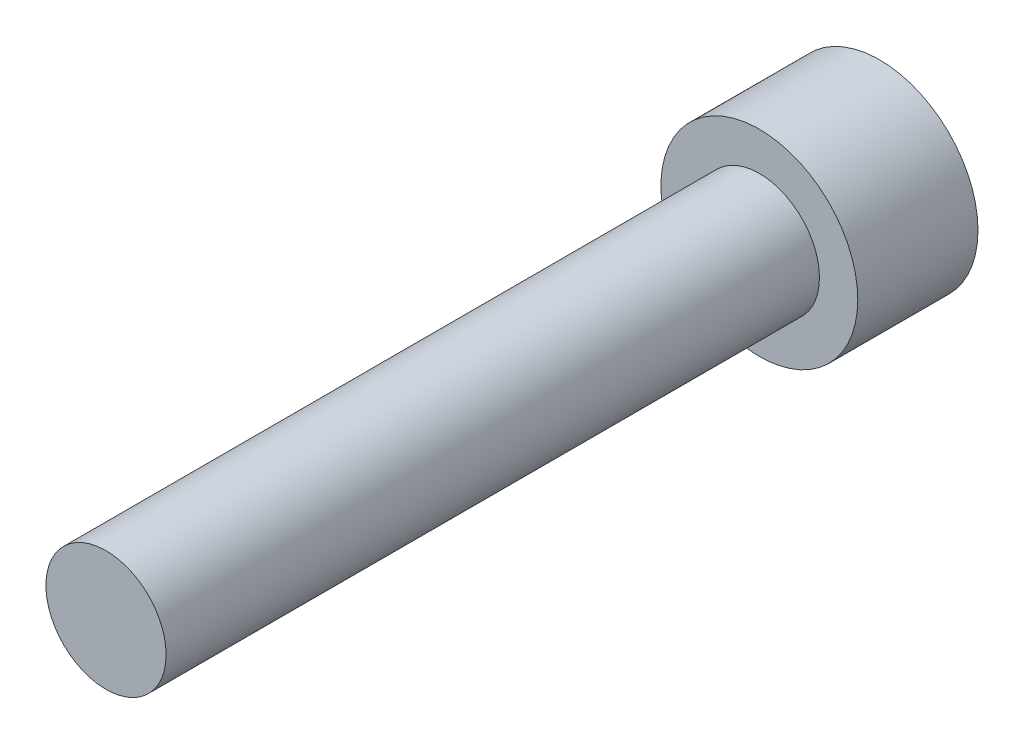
from build123d import *

# Parameters (mm, degrees)
HEX_2_DEPTH = 2.032


with BuildPart() as part:
    # Sketch6 → Revolve1 (revolve)
    with BuildSketch(Plane(origin=(0, 0, 0), x_dir=(0, 0, -1), z_dir=(1, 0, 0)), mode=Mode.PRIVATE) as revolve1_sk:
        Polygon((-19.05, 0), (-19.05, -1.7526), (0, -1.7526), (0, -2.8702), (3.5052, -2.8702), (3.5052, 0), align=None)
    revolve(revolve1_sk.sketch.rotate(Axis((0, 0, 19.05), (0, 0, -1)), 270), axis=Axis((0, 0, 19.05), (0, 0, -1)))

    # Sketch7 → HEX 2 (cut)
    with BuildSketch(Plane(origin=(0, 0, -3.5052), x_dir=(-1, 0, 0), z_dir=(0, 0, -1))):
        Polygon((-1.3843, 0.799225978), (-1.3843, -0.799225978), (0, -1.598451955), (1.3843, -0.799225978), (1.3843, 0.799225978), (0, 1.598451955), align=None)
    extrude(amount=-HEX_2_DEPTH, mode=Mode.SUBTRACT)


solid = part.part
